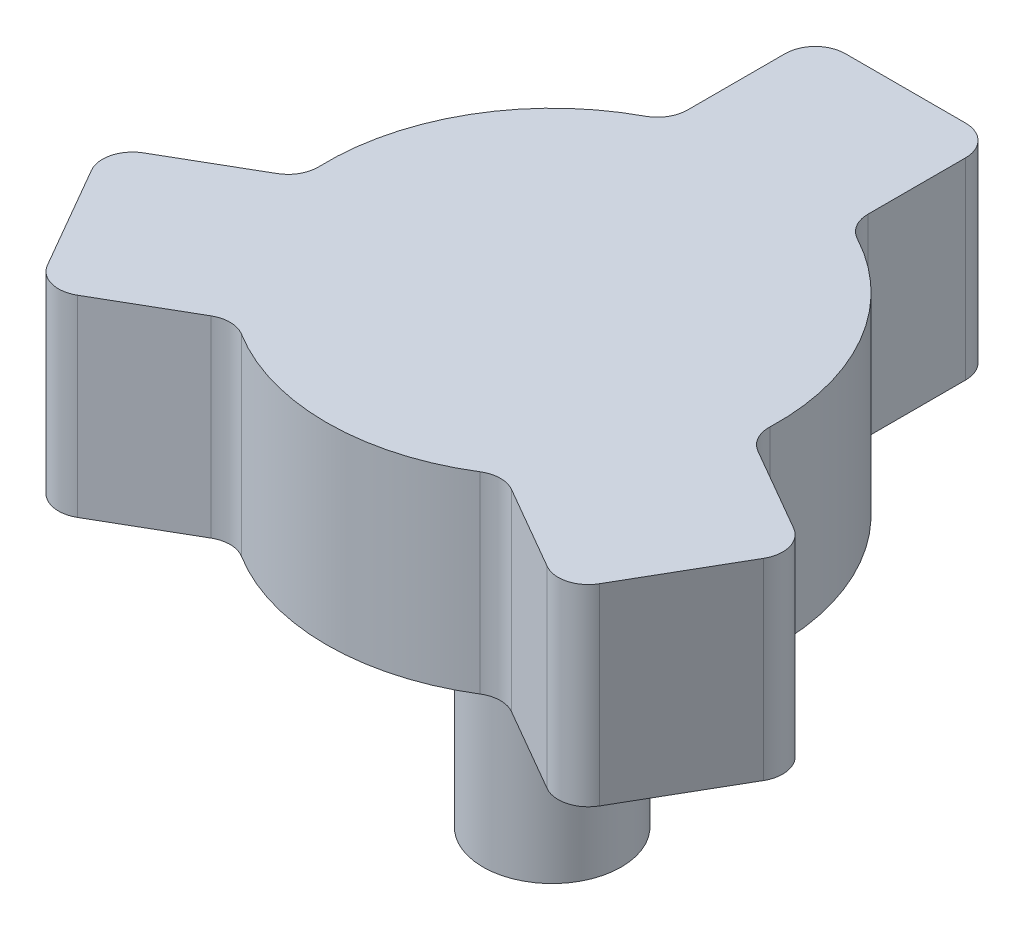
ISO-10303-21;
HEADER;
FILE_DESCRIPTION(('STEP AP214'),'2;1');
FILE_NAME('part.step','',(''),(''),'','','');
FILE_SCHEMA(('AUTOMOTIVE_DESIGN { 1 0 10303 214 1 1 1 1 }'));
ENDSEC;
DATA;
#1=APPLICATION_CONTEXT('core data for automotive mechanical design processes');
#2=APPLICATION_PROTOCOL_DEFINITION('international standard','automotive_design',2000,#1);
#3=PRODUCT_CONTEXT('',#1,'mechanical');
#4=PRODUCT('Part','Part','',(#3));
#5=PRODUCT_RELATED_PRODUCT_CATEGORY('part','',(#4));
#6=PRODUCT_DEFINITION_FORMATION('','',#4);
#7=PRODUCT_DEFINITION_CONTEXT('part definition',#1,'design');
#8=PRODUCT_DEFINITION('design','',#6,#7);
#9=PRODUCT_DEFINITION_SHAPE('','',#8);
#10=(LENGTH_UNIT() NAMED_UNIT(*) SI_UNIT(.MILLI.,.METRE.));
#11=(NAMED_UNIT(*) PLANE_ANGLE_UNIT() SI_UNIT($,.RADIAN.));
#12=(NAMED_UNIT(*) SI_UNIT($,.STERADIAN.) SOLID_ANGLE_UNIT());
#13=UNCERTAINTY_MEASURE_WITH_UNIT(LENGTH_MEASURE(1.E-05),#10,'distance_accuracy_value','');
#14=(GEOMETRIC_REPRESENTATION_CONTEXT(3) GLOBAL_UNCERTAINTY_ASSIGNED_CONTEXT((#13)) GLOBAL_UNIT_ASSIGNED_CONTEXT((#10,
#11,#12)) REPRESENTATION_CONTEXT('',''));
#15=CARTESIAN_POINT('',(0.,0.,0.));
#16=DIRECTION('',(0.,0.,1.));
#17=DIRECTION('',(1.,0.,0.));
#18=AXIS2_PLACEMENT_3D('',#15,#16,#17);
#19=CARTESIAN_POINT('',(0.,8.128,0.));
#20=DIRECTION('',(0.,-1.,0.));
#21=DIRECTION('',(0.,0.,-1.));
#22=AXIS2_PLACEMENT_3D('',#19,#20,#21);
#23=CYLINDRICAL_SURFACE('',#22,9.525);
#24=CARTESIAN_POINT('',(0.,0.,0.));
#25=DIRECTION('',(0.,1.,0.));
#26=DIRECTION('',(0.,0.,1.));
#27=AXIS2_PLACEMENT_3D('',#24,#25,#26);
#28=CIRCLE('',#27,9.525);
#29=CARTESIAN_POINT('',(-4.48235294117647,0.,-8.40441176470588));
#30=VERTEX_POINT('',#29);
#31=CARTESIAN_POINT('',(-9.51961056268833,0.,0.320374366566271));
#32=VERTEX_POINT('',#31);
#33=EDGE_CURVE('E211',#30,#32,#28,.T.);
#34=ORIENTED_EDGE('',*,*,#33,.T.);
#35=DIRECTION('',(0.,-1.,0.));
#36=VECTOR('',#35,1.);
#37=CARTESIAN_POINT('',(-9.51961056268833,8.128,0.320374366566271));
#38=LINE('',#37,#36);
#39=CARTESIAN_POINT('',(-9.51961056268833,8.128,0.320374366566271));
#40=VERTEX_POINT('',#39);
#41=EDGE_CURVE('E398',#32,#40,#38,.F.);
#42=ORIENTED_EDGE('',*,*,#41,.T.);
#43=CARTESIAN_POINT('',(0.,8.128,0.));
#44=DIRECTION('',(0.,1.,0.));
#45=DIRECTION('',(0.,0.,1.));
#46=AXIS2_PLACEMENT_3D('',#43,#44,#45);
#47=CIRCLE('',#46,9.525);
#48=CARTESIAN_POINT('',(-4.48235294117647,8.128,-8.40441176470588));
#49=VERTEX_POINT('',#48);
#50=EDGE_CURVE('E214',#49,#40,#47,.T.);
#51=ORIENTED_EDGE('',*,*,#50,.F.);
#52=DIRECTION('',(0.,-1.,0.));
#53=VECTOR('',#52,1.);
#54=CARTESIAN_POINT('',(-4.48235294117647,8.128,-8.40441176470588));
#55=LINE('',#54,#53);
#56=EDGE_CURVE('E199',#49,#30,#55,.T.);
#57=ORIENTED_EDGE('',*,*,#56,.T.);
#58=EDGE_LOOP('',(#34,#42,#51,#57));
#59=FACE_BOUND('',#58,.T.);
#60=ADVANCED_FACE('F33',(#59),#23,.T.);
#61=CARTESIAN_POINT('',(-5.03725762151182,0.,8.08403739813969));
#62=VERTEX_POINT('',#61);
#63=CARTESIAN_POINT('',(5.03725762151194,0.,8.08403739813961));
#64=VERTEX_POINT('',#63);
#65=EDGE_CURVE('E223',#62,#64,#28,.T.);
#66=ORIENTED_EDGE('',*,*,#65,.T.);
#67=DIRECTION('',(0.,-1.,0.));
#68=VECTOR('',#67,1.);
#69=CARTESIAN_POINT('',(5.03725762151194,8.128,8.08403739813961));
#70=LINE('',#69,#68);
#71=CARTESIAN_POINT('',(5.03725762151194,8.128,8.08403739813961));
#72=VERTEX_POINT('',#71);
#73=EDGE_CURVE('E269',#64,#72,#70,.F.);
#74=ORIENTED_EDGE('',*,*,#73,.T.);
#75=CARTESIAN_POINT('',(-5.03725762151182,8.128,8.08403739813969));
#76=VERTEX_POINT('',#75);
#77=EDGE_CURVE('E226',#76,#72,#47,.T.);
#78=ORIENTED_EDGE('',*,*,#77,.F.);
#79=DIRECTION('',(0.,-1.,0.));
#80=VECTOR('',#79,1.);
#81=CARTESIAN_POINT('',(-5.03725762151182,8.128,8.08403739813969));
#82=LINE('',#81,#80);
#83=EDGE_CURVE('E266',#76,#62,#82,.T.);
#84=ORIENTED_EDGE('',*,*,#83,.T.);
#85=EDGE_LOOP('',(#66,#74,#78,#84));
#86=FACE_BOUND('',#85,.T.);
#87=ADVANCED_FACE('F265',(#86),#23,.T.);
#88=CARTESIAN_POINT('',(9.51961056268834,8.128,0.320374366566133));
#89=VERTEX_POINT('',#88);
#90=CARTESIAN_POINT('',(4.48235294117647,8.128,-8.40441176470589));
#91=VERTEX_POINT('',#90);
#92=EDGE_CURVE('E222',#89,#91,#47,.T.);
#93=ORIENTED_EDGE('',*,*,#92,.F.);
#94=DIRECTION('',(0.,-1.,0.));
#95=VECTOR('',#94,1.);
#96=CARTESIAN_POINT('',(9.51961056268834,8.128,0.320374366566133));
#97=LINE('',#96,#95);
#98=CARTESIAN_POINT('',(9.51961056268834,0.,0.320374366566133));
#99=VERTEX_POINT('',#98);
#100=EDGE_CURVE('E308',#89,#99,#97,.T.);
#101=ORIENTED_EDGE('',*,*,#100,.T.);
#102=CARTESIAN_POINT('',(4.48235294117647,0.,-8.40441176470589));
#103=VERTEX_POINT('',#102);
#104=EDGE_CURVE('E225',#99,#103,#28,.T.);
#105=ORIENTED_EDGE('',*,*,#104,.T.);
#106=DIRECTION('',(0.,-1.,0.));
#107=VECTOR('',#106,1.);
#108=CARTESIAN_POINT('',(4.48235294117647,8.128,-8.40441176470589));
#109=LINE('',#108,#107);
#110=EDGE_CURVE('E215',#103,#91,#109,.F.);
#111=ORIENTED_EDGE('',*,*,#110,.T.);
#112=EDGE_LOOP('',(#93,#101,#105,#111));
#113=FACE_BOUND('',#112,.T.);
#114=ADVANCED_FACE('F324',(#113),#23,.T.);
#115=CARTESIAN_POINT('',(0.,8.128,0.));
#116=DIRECTION('',(0.,1.,0.));
#117=DIRECTION('',(0.,0.,1.));
#118=AXIS2_PLACEMENT_3D('',#115,#116,#117);
#119=PLANE('',#118);
#120=DIRECTION('',(0.866025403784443,0.,0.499999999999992));
#121=VECTOR('',#120,1.);
#122=CARTESIAN_POINT('',(11.0167753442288,8.128,10.7599472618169));
#123=LINE('',#122,#121);
#124=CARTESIAN_POINT('',(6.34389197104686,8.128,8.06205678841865));
#125=VERTEX_POINT('',#124);
#126=CARTESIAN_POINT('',(9.91692308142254,8.128,10.1249472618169));
#127=VERTEX_POINT('',#126);
#128=EDGE_CURVE('E341',#125,#127,#123,.T.);
#129=ORIENTED_EDGE('',*,*,#128,.T.);
#130=CARTESIAN_POINT('',(10.5519230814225,8.128,9.02509499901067));
#131=DIRECTION('',(0.,1.,0.));
#132=DIRECTION('',(0.,0.,1.));
#133=AXIS2_PLACEMENT_3D('',#130,#131,#132);
#134=CIRCLE('',#133,1.27);
#135=CARTESIAN_POINT('',(11.6517753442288,8.128,9.66009499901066));
#136=VERTEX_POINT('',#135);
#137=EDGE_CURVE('E297',#127,#136,#134,.T.);
#138=ORIENTED_EDGE('',*,*,#137,.T.);
#139=DIRECTION('',(0.499999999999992,0.,-0.866025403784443));
#140=VECTOR('',#139,1.);
#141=CARTESIAN_POINT('',(14.8267753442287,8.128,4.16083368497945));
#142=LINE('',#141,#140);
#143=CARTESIAN_POINT('',(14.1917753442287,8.128,5.26068594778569));
#144=VERTEX_POINT('',#143);
#145=EDGE_CURVE('E343',#136,#144,#142,.T.);
#146=ORIENTED_EDGE('',*,*,#145,.T.);
#147=CARTESIAN_POINT('',(13.0919230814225,8.128,4.6256859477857));
#148=DIRECTION('',(0.,1.,0.));
#149=DIRECTION('',(0.,0.,1.));
#150=AXIS2_PLACEMENT_3D('',#147,#148,#149);
#151=CIRCLE('',#150,1.27);
#152=CARTESIAN_POINT('',(13.7269230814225,8.128,3.52583368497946));
#153=VERTEX_POINT('',#152);
#154=EDGE_CURVE('E295',#144,#153,#151,.T.);
#155=ORIENTED_EDGE('',*,*,#154,.T.);
#156=DIRECTION('',(-0.866025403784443,0.,-0.499999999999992));
#157=VECTOR('',#156,1.);
#158=CARTESIAN_POINT('',(14.8267753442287,8.128,4.16083368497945));
#159=LINE('',#158,#157);
#160=CARTESIAN_POINT('',(10.1538919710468,8.128,1.46294321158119));
#161=VERTEX_POINT('',#160);
#162=EDGE_CURVE('E320',#153,#161,#159,.T.);
#163=ORIENTED_EDGE('',*,*,#162,.T.);
#164=CARTESIAN_POINT('',(10.7888919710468,8.128,0.363090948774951));
#165=DIRECTION('',(0.,1.,0.));
#166=DIRECTION('',(0.,0.,1.));
#167=AXIS2_PLACEMENT_3D('',#164,#165,#166);
#168=CIRCLE('',#167,1.27);
#169=EDGE_CURVE('E41',#161,#89,#168,.F.);
#170=ORIENTED_EDGE('',*,*,#169,.T.);
#171=ORIENTED_EDGE('',*,*,#92,.T.);
#172=CARTESIAN_POINT('',(5.08,8.128,-9.525));
#173=DIRECTION('',(0.,1.,0.));
#174=DIRECTION('',(0.,0.,1.));
#175=AXIS2_PLACEMENT_3D('',#172,#173,#174);
#176=CIRCLE('',#175,1.27);
#177=CARTESIAN_POINT('',(3.81,8.128,-9.525));
#178=VERTEX_POINT('',#177);
#179=EDGE_CURVE('E394',#91,#178,#176,.F.);
#180=ORIENTED_EDGE('',*,*,#179,.T.);
#181=DIRECTION('',(0.,0.,-1.));
#182=VECTOR('',#181,1.);
#183=CARTESIAN_POINT('',(3.80999999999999,8.128,-14.9207809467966));
#184=LINE('',#183,#182);
#185=CARTESIAN_POINT('',(3.80999999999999,8.128,-13.6507809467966));
#186=VERTEX_POINT('',#185);
#187=EDGE_CURVE('E242',#178,#186,#184,.T.);
#188=ORIENTED_EDGE('',*,*,#187,.T.);
#189=CARTESIAN_POINT('',(2.54,8.128,-13.6507809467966));
#190=DIRECTION('',(0.,1.,0.));
#191=DIRECTION('',(0.,0.,1.));
#192=AXIS2_PLACEMENT_3D('',#189,#190,#191);
#193=CIRCLE('',#192,1.27);
#194=CARTESIAN_POINT('',(2.54,8.128,-14.9207809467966));
#195=VERTEX_POINT('',#194);
#196=EDGE_CURVE('E375',#186,#195,#193,.T.);
#197=ORIENTED_EDGE('',*,*,#196,.T.);
#198=DIRECTION('',(-1.,0.,0.));
#199=VECTOR('',#198,1.);
#200=CARTESIAN_POINT('',(-3.81,8.128,-14.9207809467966));
#201=LINE('',#200,#199);
#202=CARTESIAN_POINT('',(-2.54,8.128,-14.9207809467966));
#203=VERTEX_POINT('',#202);
#204=EDGE_CURVE('E245',#195,#203,#201,.T.);
#205=ORIENTED_EDGE('',*,*,#204,.T.);
#206=CARTESIAN_POINT('',(-2.54,8.128,-13.6507809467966));
#207=DIRECTION('',(0.,1.,0.));
#208=DIRECTION('',(0.,0.,1.));
#209=AXIS2_PLACEMENT_3D('',#206,#207,#208);
#210=CIRCLE('',#209,1.27);
#211=CARTESIAN_POINT('',(-3.81,8.128,-13.6507809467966));
#212=VERTEX_POINT('',#211);
#213=EDGE_CURVE('E377',#203,#212,#210,.T.);
#214=ORIENTED_EDGE('',*,*,#213,.T.);
#215=DIRECTION('',(0.,0.,1.));
#216=VECTOR('',#215,1.);
#217=CARTESIAN_POINT('',(-3.81,8.128,-14.9207809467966));
#218=LINE('',#217,#216);
#219=CARTESIAN_POINT('',(-3.81,8.128,-9.525));
#220=VERTEX_POINT('',#219);
#221=EDGE_CURVE('E249',#212,#220,#218,.T.);
#222=ORIENTED_EDGE('',*,*,#221,.T.);
#223=CARTESIAN_POINT('',(-5.08,8.128,-9.525));
#224=DIRECTION('',(0.,1.,0.));
#225=DIRECTION('',(0.,0.,1.));
#226=AXIS2_PLACEMENT_3D('',#223,#224,#225);
#227=CIRCLE('',#226,1.27);
#228=EDGE_CURVE('E204',#220,#49,#227,.F.);
#229=ORIENTED_EDGE('',*,*,#228,.T.);
#230=ORIENTED_EDGE('',*,*,#50,.T.);
#231=CARTESIAN_POINT('',(-10.7888919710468,8.128,0.363090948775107));
#232=DIRECTION('',(0.,1.,0.));
#233=DIRECTION('',(0.,0.,1.));
#234=AXIS2_PLACEMENT_3D('',#231,#232,#233);
#235=CIRCLE('',#234,1.27);
#236=CARTESIAN_POINT('',(-10.1538919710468,8.128,1.46294321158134));
#237=VERTEX_POINT('',#236);
#238=EDGE_CURVE('E284',#40,#237,#235,.F.);
#239=ORIENTED_EDGE('',*,*,#238,.T.);
#240=DIRECTION('',(-0.866025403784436,0.,0.500000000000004));
#241=VECTOR('',#240,1.);
#242=CARTESIAN_POINT('',(-14.8267753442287,8.128,4.16083368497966));
#243=LINE('',#242,#241);
#244=CARTESIAN_POINT('',(-13.7269230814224,8.128,3.52583368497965));
#245=VERTEX_POINT('',#244);
#246=EDGE_CURVE('E330',#237,#245,#243,.T.);
#247=ORIENTED_EDGE('',*,*,#246,.T.);
#248=CARTESIAN_POINT('',(-13.0919230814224,8.128,4.62568594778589));
#249=DIRECTION('',(0.,1.,0.));
#250=DIRECTION('',(0.,0.,1.));
#251=AXIS2_PLACEMENT_3D('',#248,#249,#250);
#252=CIRCLE('',#251,1.27);
#253=CARTESIAN_POINT('',(-14.1917753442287,8.128,5.26068594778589));
#254=VERTEX_POINT('',#253);
#255=EDGE_CURVE('E407',#245,#254,#252,.T.);
#256=ORIENTED_EDGE('',*,*,#255,.T.);
#257=DIRECTION('',(0.500000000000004,0.,0.866025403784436));
#258=VECTOR('',#257,1.);
#259=CARTESIAN_POINT('',(-11.0167753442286,8.128,10.7599472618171));
#260=LINE('',#259,#258);
#261=CARTESIAN_POINT('',(-11.6517753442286,8.128,9.66009499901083));
#262=VERTEX_POINT('',#261);
#263=EDGE_CURVE('E334',#254,#262,#260,.T.);
#264=ORIENTED_EDGE('',*,*,#263,.T.);
#265=CARTESIAN_POINT('',(-10.5519230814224,8.128,9.02509499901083));
#266=DIRECTION('',(0.,1.,0.));
#267=DIRECTION('',(0.,0.,1.));
#268=AXIS2_PLACEMENT_3D('',#265,#266,#267);
#269=CIRCLE('',#268,1.27);
#270=CARTESIAN_POINT('',(-9.91692308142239,8.128,10.1249472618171));
#271=VERTEX_POINT('',#270);
#272=EDGE_CURVE('E405',#262,#271,#269,.T.);
#273=ORIENTED_EDGE('',*,*,#272,.T.);
#274=DIRECTION('',(0.866025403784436,0.,-0.500000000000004));
#275=VECTOR('',#274,1.);
#276=CARTESIAN_POINT('',(-11.0167753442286,8.128,10.7599472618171));
#277=LINE('',#276,#275);
#278=CARTESIAN_POINT('',(-6.34389197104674,8.128,8.06205678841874));
#279=VERTEX_POINT('',#278);
#280=EDGE_CURVE('E352',#271,#279,#277,.T.);
#281=ORIENTED_EDGE('',*,*,#280,.T.);
#282=CARTESIAN_POINT('',(-5.70889197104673,8.128,9.16190905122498));
#283=DIRECTION('',(0.,1.,0.));
#284=DIRECTION('',(0.,0.,1.));
#285=AXIS2_PLACEMENT_3D('',#282,#283,#284);
#286=CIRCLE('',#285,1.27);
#287=EDGE_CURVE('E260',#279,#76,#286,.F.);
#288=ORIENTED_EDGE('',*,*,#287,.T.);
#289=ORIENTED_EDGE('',*,*,#77,.T.);
#290=CARTESIAN_POINT('',(5.70889197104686,8.128,9.1619090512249));
#291=DIRECTION('',(0.,1.,0.));
#292=DIRECTION('',(0.,0.,1.));
#293=AXIS2_PLACEMENT_3D('',#290,#291,#292);
#294=CIRCLE('',#293,1.27);
#295=EDGE_CURVE('E256',#72,#125,#294,.F.);
#296=ORIENTED_EDGE('',*,*,#295,.T.);
#297=EDGE_LOOP('',(#129,#138,#146,#155,#163,#170,#171,#180,#188,#197,#205,#214,#222,#229,#230,
#239,#247,#256,#264,#273,#281,#288,#289,#296));
#298=FACE_BOUND('',#297,.T.);
#299=ADVANCED_FACE('F255',(#298),#119,.T.);
#300=CARTESIAN_POINT('',(0.,0.,0.));
#301=DIRECTION('',(0.,1.,0.));
#302=DIRECTION('',(0.,0.,1.));
#303=AXIS2_PLACEMENT_3D('',#300,#301,#302);
#304=PLANE('',#303);
#305=CARTESIAN_POINT('',(0.,0.,0.));
#306=DIRECTION('',(0.,1.,0.));
#307=DIRECTION('',(0.,0.,1.));
#308=AXIS2_PLACEMENT_3D('',#305,#306,#307);
#309=CIRCLE('',#308,2.921);
#310=CARTESIAN_POINT('',(0.,0.,2.921));
#311=VERTEX_POINT('',#310);
#312=EDGE_CURVE('E11',#311,#311,#309,.F.);
#313=ORIENTED_EDGE('',*,*,#312,.F.);
#314=EDGE_LOOP('',(#313));
#315=FACE_BOUND('',#314,.T.);
#316=DIRECTION('',(0.499999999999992,0.,-0.866025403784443));
#317=VECTOR('',#316,1.);
#318=CARTESIAN_POINT('',(14.8267753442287,0.,4.16083368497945));
#319=LINE('',#318,#317);
#320=CARTESIAN_POINT('',(11.6517753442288,0.,9.66009499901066));
#321=VERTEX_POINT('',#320);
#322=CARTESIAN_POINT('',(14.1917753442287,0.,5.26068594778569));
#323=VERTEX_POINT('',#322);
#324=EDGE_CURVE('E331',#321,#323,#319,.T.);
#325=ORIENTED_EDGE('',*,*,#324,.F.);
#326=CARTESIAN_POINT('',(10.5519230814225,0.,9.02509499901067));
#327=DIRECTION('',(0.,1.,0.));
#328=DIRECTION('',(0.,0.,1.));
#329=AXIS2_PLACEMENT_3D('',#326,#327,#328);
#330=CIRCLE('',#329,1.27);
#331=CARTESIAN_POINT('',(9.91692308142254,0.,10.1249472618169));
#332=VERTEX_POINT('',#331);
#333=EDGE_CURVE('E306',#321,#332,#330,.F.);
#334=ORIENTED_EDGE('',*,*,#333,.T.);
#335=DIRECTION('',(0.866025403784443,0.,0.499999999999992));
#336=VECTOR('',#335,1.);
#337=CARTESIAN_POINT('',(11.0167753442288,0.,10.7599472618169));
#338=LINE('',#337,#336);
#339=CARTESIAN_POINT('',(6.34389197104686,0.,8.06205678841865));
#340=VERTEX_POINT('',#339);
#341=EDGE_CURVE('E337',#340,#332,#338,.T.);
#342=ORIENTED_EDGE('',*,*,#341,.F.);
#343=CARTESIAN_POINT('',(5.70889197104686,0.,9.1619090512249));
#344=DIRECTION('',(0.,1.,0.));
#345=DIRECTION('',(0.,0.,1.));
#346=AXIS2_PLACEMENT_3D('',#343,#344,#345);
#347=CIRCLE('',#346,1.27);
#348=EDGE_CURVE('E314',#340,#64,#347,.T.);
#349=ORIENTED_EDGE('',*,*,#348,.T.);
#350=ORIENTED_EDGE('',*,*,#65,.F.);
#351=CARTESIAN_POINT('',(-5.70889197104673,0.,9.16190905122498));
#352=DIRECTION('',(0.,1.,0.));
#353=DIRECTION('',(0.,0.,1.));
#354=AXIS2_PLACEMENT_3D('',#351,#352,#353);
#355=CIRCLE('',#354,1.27);
#356=CARTESIAN_POINT('',(-6.34389197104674,0.,8.06205678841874));
#357=VERTEX_POINT('',#356);
#358=EDGE_CURVE('E273',#62,#357,#355,.T.);
#359=ORIENTED_EDGE('',*,*,#358,.T.);
#360=DIRECTION('',(0.866025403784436,0.,-0.500000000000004));
#361=VECTOR('',#360,1.);
#362=CARTESIAN_POINT('',(-11.0167753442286,0.,10.7599472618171));
#363=LINE('',#362,#361);
#364=CARTESIAN_POINT('',(-9.91692308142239,0.,10.1249472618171));
#365=VERTEX_POINT('',#364);
#366=EDGE_CURVE('E246',#365,#357,#363,.T.);
#367=ORIENTED_EDGE('',*,*,#366,.F.);
#368=CARTESIAN_POINT('',(-10.5519230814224,0.,9.02509499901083));
#369=DIRECTION('',(0.,1.,0.));
#370=DIRECTION('',(0.,0.,1.));
#371=AXIS2_PLACEMENT_3D('',#368,#369,#370);
#372=CIRCLE('',#371,1.27);
#373=CARTESIAN_POINT('',(-11.6517753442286,0.,9.66009499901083));
#374=VERTEX_POINT('',#373);
#375=EDGE_CURVE('E279',#365,#374,#372,.F.);
#376=ORIENTED_EDGE('',*,*,#375,.T.);
#377=DIRECTION('',(0.500000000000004,0.,0.866025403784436));
#378=VECTOR('',#377,1.);
#379=CARTESIAN_POINT('',(-11.0167753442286,0.,10.7599472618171));
#380=LINE('',#379,#378);
#381=CARTESIAN_POINT('',(-14.1917753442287,0.,5.26068594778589));
#382=VERTEX_POINT('',#381);
#383=EDGE_CURVE('E351',#382,#374,#380,.T.);
#384=ORIENTED_EDGE('',*,*,#383,.F.);
#385=CARTESIAN_POINT('',(-13.0919230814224,0.,4.62568594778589));
#386=DIRECTION('',(0.,1.,0.));
#387=DIRECTION('',(0.,0.,1.));
#388=AXIS2_PLACEMENT_3D('',#385,#386,#387);
#389=CIRCLE('',#388,1.27);
#390=CARTESIAN_POINT('',(-13.7269230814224,0.,3.52583368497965));
#391=VERTEX_POINT('',#390);
#392=EDGE_CURVE('E275',#382,#391,#389,.F.);
#393=ORIENTED_EDGE('',*,*,#392,.T.);
#394=DIRECTION('',(-0.866025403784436,0.,0.500000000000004));
#395=VECTOR('',#394,1.);
#396=CARTESIAN_POINT('',(-14.8267753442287,0.,4.16083368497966));
#397=LINE('',#396,#395);
#398=CARTESIAN_POINT('',(-10.1538919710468,0.,1.46294321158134));
#399=VERTEX_POINT('',#398);
#400=EDGE_CURVE('E348',#399,#391,#397,.T.);
#401=ORIENTED_EDGE('',*,*,#400,.F.);
#402=CARTESIAN_POINT('',(-10.7888919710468,0.,0.363090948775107));
#403=DIRECTION('',(0.,1.,0.));
#404=DIRECTION('',(0.,0.,1.));
#405=AXIS2_PLACEMENT_3D('',#402,#403,#404);
#406=CIRCLE('',#405,1.27);
#407=EDGE_CURVE('E221',#399,#32,#406,.T.);
#408=ORIENTED_EDGE('',*,*,#407,.T.);
#409=ORIENTED_EDGE('',*,*,#33,.F.);
#410=CARTESIAN_POINT('',(-5.08,0.,-9.525));
#411=DIRECTION('',(0.,1.,0.));
#412=DIRECTION('',(0.,0.,1.));
#413=AXIS2_PLACEMENT_3D('',#410,#411,#412);
#414=CIRCLE('',#413,1.27);
#415=CARTESIAN_POINT('',(-3.81,0.,-9.525));
#416=VERTEX_POINT('',#415);
#417=EDGE_CURVE('E195',#30,#416,#414,.T.);
#418=ORIENTED_EDGE('',*,*,#417,.T.);
#419=DIRECTION('',(0.,0.,1.));
#420=VECTOR('',#419,1.);
#421=CARTESIAN_POINT('',(-3.81,0.,-14.9207809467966));
#422=LINE('',#421,#420);
#423=CARTESIAN_POINT('',(-3.81,0.,-13.6507809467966));
#424=VERTEX_POINT('',#423);
#425=EDGE_CURVE('E229',#424,#416,#422,.T.);
#426=ORIENTED_EDGE('',*,*,#425,.F.);
#427=CARTESIAN_POINT('',(-2.54,0.,-13.6507809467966));
#428=DIRECTION('',(0.,1.,0.));
#429=DIRECTION('',(0.,0.,1.));
#430=AXIS2_PLACEMENT_3D('',#427,#428,#429);
#431=CIRCLE('',#430,1.27);
#432=CARTESIAN_POINT('',(-2.54,0.,-14.9207809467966));
#433=VERTEX_POINT('',#432);
#434=EDGE_CURVE('E388',#424,#433,#431,.F.);
#435=ORIENTED_EDGE('',*,*,#434,.T.);
#436=DIRECTION('',(-1.,0.,0.));
#437=VECTOR('',#436,1.);
#438=CARTESIAN_POINT('',(-3.81,0.,-14.9207809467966));
#439=LINE('',#438,#437);
#440=CARTESIAN_POINT('',(2.54,0.,-14.9207809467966));
#441=VERTEX_POINT('',#440);
#442=EDGE_CURVE('E234',#441,#433,#439,.T.);
#443=ORIENTED_EDGE('',*,*,#442,.F.);
#444=CARTESIAN_POINT('',(2.54,0.,-13.6507809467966));
#445=DIRECTION('',(0.,1.,0.));
#446=DIRECTION('',(0.,0.,1.));
#447=AXIS2_PLACEMENT_3D('',#444,#445,#446);
#448=CIRCLE('',#447,1.27);
#449=CARTESIAN_POINT('',(3.80999999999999,0.,-13.6507809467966));
#450=VERTEX_POINT('',#449);
#451=EDGE_CURVE('E374',#441,#450,#448,.F.);
#452=ORIENTED_EDGE('',*,*,#451,.T.);
#453=DIRECTION('',(0.,0.,-1.));
#454=VECTOR('',#453,1.);
#455=CARTESIAN_POINT('',(3.80999999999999,0.,-14.9207809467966));
#456=LINE('',#455,#454);
#457=CARTESIAN_POINT('',(3.81,0.,-9.525));
#458=VERTEX_POINT('',#457);
#459=EDGE_CURVE('E238',#458,#450,#456,.T.);
#460=ORIENTED_EDGE('',*,*,#459,.F.);
#461=CARTESIAN_POINT('',(5.08,0.,-9.525));
#462=DIRECTION('',(0.,1.,0.));
#463=DIRECTION('',(0.,0.,1.));
#464=AXIS2_PLACEMENT_3D('',#461,#462,#463);
#465=CIRCLE('',#464,1.27);
#466=EDGE_CURVE('E205',#458,#103,#465,.T.);
#467=ORIENTED_EDGE('',*,*,#466,.T.);
#468=ORIENTED_EDGE('',*,*,#104,.F.);
#469=CARTESIAN_POINT('',(10.7888919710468,0.,0.363090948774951));
#470=DIRECTION('',(0.,1.,0.));
#471=DIRECTION('',(0.,0.,1.));
#472=AXIS2_PLACEMENT_3D('',#469,#470,#471);
#473=CIRCLE('',#472,1.27);
#474=CARTESIAN_POINT('',(10.1538919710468,0.,1.46294321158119));
#475=VERTEX_POINT('',#474);
#476=EDGE_CURVE('E48',#99,#475,#473,.T.);
#477=ORIENTED_EDGE('',*,*,#476,.T.);
#478=DIRECTION('',(-0.866025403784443,0.,-0.499999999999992));
#479=VECTOR('',#478,1.);
#480=CARTESIAN_POINT('',(14.8267753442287,0.,4.16083368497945));
#481=LINE('',#480,#479);
#482=CARTESIAN_POINT('',(13.7269230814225,0.,3.52583368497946));
#483=VERTEX_POINT('',#482);
#484=EDGE_CURVE('E328',#483,#475,#481,.T.);
#485=ORIENTED_EDGE('',*,*,#484,.F.);
#486=CARTESIAN_POINT('',(13.0919230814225,0.,4.6256859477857));
#487=DIRECTION('',(0.,1.,0.));
#488=DIRECTION('',(0.,0.,1.));
#489=AXIS2_PLACEMENT_3D('',#486,#487,#488);
#490=CIRCLE('',#489,1.27);
#491=EDGE_CURVE('E304',#483,#323,#490,.F.);
#492=ORIENTED_EDGE('',*,*,#491,.T.);
#493=EDGE_LOOP('',(#325,#334,#342,#349,#350,#359,#367,#376,#384,#393,#401,#408,#409,#418,#426,
#435,#443,#452,#460,#467,#468,#477,#485,#492));
#494=FACE_BOUND('',#493,.T.);
#495=ADVANCED_FACE('F218',(#315,#494),#304,.F.);
#496=CARTESIAN_POINT('',(3.80999999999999,0.,-14.9207809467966));
#497=DIRECTION('',(1.,0.,0.));
#498=DIRECTION('',(0.,0.,-1.));
#499=AXIS2_PLACEMENT_3D('',#496,#497,#498);
#500=PLANE('',#499);
#501=ORIENTED_EDGE('',*,*,#187,.F.);
#502=DIRECTION('',(0.,-1.,0.));
#503=VECTOR('',#502,1.);
#504=CARTESIAN_POINT('',(3.81,0.,-9.525));
#505=LINE('',#504,#503);
#506=EDGE_CURVE('E368',#178,#458,#505,.T.);
#507=ORIENTED_EDGE('',*,*,#506,.T.);
#508=ORIENTED_EDGE('',*,*,#459,.T.);
#509=DIRECTION('',(0.,1.,0.));
#510=VECTOR('',#509,1.);
#511=CARTESIAN_POINT('',(3.80999999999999,0.,-13.6507809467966));
#512=LINE('',#511,#510);
#513=EDGE_CURVE('E366',#450,#186,#512,.T.);
#514=ORIENTED_EDGE('',*,*,#513,.T.);
#515=EDGE_LOOP('',(#501,#507,#508,#514));
#516=FACE_BOUND('',#515,.T.);
#517=ADVANCED_FACE('F365',(#516),#500,.T.);
#518=CARTESIAN_POINT('',(-3.81,0.,-14.9207809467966));
#519=DIRECTION('',(-1.,0.,0.));
#520=DIRECTION('',(0.,0.,1.));
#521=AXIS2_PLACEMENT_3D('',#518,#519,#520);
#522=PLANE('',#521);
#523=ORIENTED_EDGE('',*,*,#425,.T.);
#524=DIRECTION('',(0.,-1.,0.));
#525=VECTOR('',#524,1.);
#526=CARTESIAN_POINT('',(-3.81,0.,-9.525));
#527=LINE('',#526,#525);
#528=EDGE_CURVE('E200',#416,#220,#527,.F.);
#529=ORIENTED_EDGE('',*,*,#528,.T.);
#530=ORIENTED_EDGE('',*,*,#221,.F.);
#531=DIRECTION('',(0.,1.,0.));
#532=VECTOR('',#531,1.);
#533=CARTESIAN_POINT('',(-3.81,0.,-13.6507809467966));
#534=LINE('',#533,#532);
#535=EDGE_CURVE('E391',#212,#424,#534,.F.);
#536=ORIENTED_EDGE('',*,*,#535,.T.);
#537=EDGE_LOOP('',(#523,#529,#530,#536));
#538=FACE_BOUND('',#537,.T.);
#539=ADVANCED_FACE('F460',(#538),#522,.T.);
#540=CARTESIAN_POINT('',(-3.81,0.,-14.9207809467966));
#541=DIRECTION('',(0.,0.,-1.));
#542=DIRECTION('',(-1.,0.,0.));
#543=AXIS2_PLACEMENT_3D('',#540,#541,#542);
#544=PLANE('',#543);
#545=ORIENTED_EDGE('',*,*,#204,.F.);
#546=DIRECTION('',(0.,1.,0.));
#547=VECTOR('',#546,1.);
#548=CARTESIAN_POINT('',(2.54,0.,-14.9207809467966));
#549=LINE('',#548,#547);
#550=EDGE_CURVE('E386',#195,#441,#549,.F.);
#551=ORIENTED_EDGE('',*,*,#550,.T.);
#552=ORIENTED_EDGE('',*,*,#442,.T.);
#553=DIRECTION('',(0.,1.,0.));
#554=VECTOR('',#553,1.);
#555=CARTESIAN_POINT('',(-2.54,0.,-14.9207809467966));
#556=LINE('',#555,#554);
#557=EDGE_CURVE('E383',#433,#203,#556,.T.);
#558=ORIENTED_EDGE('',*,*,#557,.T.);
#559=EDGE_LOOP('',(#545,#551,#552,#558));
#560=FACE_BOUND('',#559,.T.);
#561=ADVANCED_FACE('F461',(#560),#544,.T.);
#562=CARTESIAN_POINT('',(5.08,8.128,-9.525));
#563=DIRECTION('',(0.,-1.,0.));
#564=DIRECTION('',(0.,0.,-1.));
#565=AXIS2_PLACEMENT_3D('',#562,#563,#564);
#566=CYLINDRICAL_SURFACE('',#565,1.27);
#567=ORIENTED_EDGE('',*,*,#466,.F.);
#568=ORIENTED_EDGE('',*,*,#506,.F.);
#569=ORIENTED_EDGE('',*,*,#179,.F.);
#570=ORIENTED_EDGE('',*,*,#110,.F.);
#571=EDGE_LOOP('',(#567,#568,#569,#570));
#572=FACE_BOUND('',#571,.T.);
#573=ADVANCED_FACE('F464',(#572),#566,.F.);
#574=CARTESIAN_POINT('',(2.54,0.,-13.6507809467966));
#575=DIRECTION('',(0.,1.,0.));
#576=DIRECTION('',(0.,0.,1.));
#577=AXIS2_PLACEMENT_3D('',#574,#575,#576);
#578=CYLINDRICAL_SURFACE('',#577,1.27);
#579=ORIENTED_EDGE('',*,*,#451,.F.);
#580=ORIENTED_EDGE('',*,*,#550,.F.);
#581=ORIENTED_EDGE('',*,*,#196,.F.);
#582=ORIENTED_EDGE('',*,*,#513,.F.);
#583=EDGE_LOOP('',(#579,#580,#581,#582));
#584=FACE_BOUND('',#583,.T.);
#585=ADVANCED_FACE('F372',(#584),#578,.T.);
#586=CARTESIAN_POINT('',(-5.08,8.128,-9.525));
#587=DIRECTION('',(0.,-1.,0.));
#588=DIRECTION('',(0.,0.,-1.));
#589=AXIS2_PLACEMENT_3D('',#586,#587,#588);
#590=CYLINDRICAL_SURFACE('',#589,1.27);
#591=ORIENTED_EDGE('',*,*,#228,.F.);
#592=ORIENTED_EDGE('',*,*,#528,.F.);
#593=ORIENTED_EDGE('',*,*,#417,.F.);
#594=ORIENTED_EDGE('',*,*,#56,.F.);
#595=EDGE_LOOP('',(#591,#592,#593,#594));
#596=FACE_BOUND('',#595,.T.);
#597=ADVANCED_FACE('F198',(#596),#590,.F.);
#598=CARTESIAN_POINT('',(-2.54,0.,-13.6507809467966));
#599=DIRECTION('',(0.,1.,0.));
#600=DIRECTION('',(0.,0.,1.));
#601=AXIS2_PLACEMENT_3D('',#598,#599,#600);
#602=CYLINDRICAL_SURFACE('',#601,1.27);
#603=ORIENTED_EDGE('',*,*,#434,.F.);
#604=ORIENTED_EDGE('',*,*,#535,.F.);
#605=ORIENTED_EDGE('',*,*,#213,.F.);
#606=ORIENTED_EDGE('',*,*,#557,.F.);
#607=EDGE_LOOP('',(#603,#604,#605,#606));
#608=FACE_BOUND('',#607,.T.);
#609=ADVANCED_FACE('F493',(#608),#602,.T.);
#610=CARTESIAN_POINT('',(14.8267753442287,0.,4.16083368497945));
#611=DIRECTION('',(0.866025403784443,0.,0.499999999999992));
#612=DIRECTION('',(0.499999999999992,0.,-0.866025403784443));
#613=AXIS2_PLACEMENT_3D('',#610,#611,#612);
#614=PLANE('',#613);
#615=ORIENTED_EDGE('',*,*,#145,.F.);
#616=DIRECTION('',(0.,1.,0.));
#617=VECTOR('',#616,1.);
#618=CARTESIAN_POINT('',(11.6517753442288,0.,9.66009499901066));
#619=LINE('',#618,#617);
#620=EDGE_CURVE('E302',#136,#321,#619,.F.);
#621=ORIENTED_EDGE('',*,*,#620,.T.);
#622=ORIENTED_EDGE('',*,*,#324,.T.);
#623=DIRECTION('',(0.,1.,0.));
#624=VECTOR('',#623,1.);
#625=CARTESIAN_POINT('',(14.1917753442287,0.,5.26068594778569));
#626=LINE('',#625,#624);
#627=EDGE_CURVE('E299',#323,#144,#626,.T.);
#628=ORIENTED_EDGE('',*,*,#627,.T.);
#629=EDGE_LOOP('',(#615,#621,#622,#628));
#630=FACE_BOUND('',#629,.T.);
#631=ADVANCED_FACE('F500',(#630),#614,.T.);
#632=CARTESIAN_POINT('',(14.8267753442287,0.,4.16083368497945));
#633=DIRECTION('',(0.499999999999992,0.,-0.866025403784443));
#634=DIRECTION('',(-0.866025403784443,0.,-0.499999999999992));
#635=AXIS2_PLACEMENT_3D('',#632,#633,#634);
#636=PLANE('',#635);
#637=ORIENTED_EDGE('',*,*,#484,.T.);
#638=DIRECTION('',(0.,-1.,0.));
#639=VECTOR('',#638,1.);
#640=CARTESIAN_POINT('',(10.1538919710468,0.,1.46294321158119));
#641=LINE('',#640,#639);
#642=EDGE_CURVE('E311',#475,#161,#641,.F.);
#643=ORIENTED_EDGE('',*,*,#642,.T.);
#644=ORIENTED_EDGE('',*,*,#162,.F.);
#645=DIRECTION('',(0.,1.,0.));
#646=VECTOR('',#645,1.);
#647=CARTESIAN_POINT('',(13.7269230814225,0.,3.52583368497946));
#648=LINE('',#647,#646);
#649=EDGE_CURVE('E55',#153,#483,#648,.F.);
#650=ORIENTED_EDGE('',*,*,#649,.T.);
#651=EDGE_LOOP('',(#637,#643,#644,#650));
#652=FACE_BOUND('',#651,.T.);
#653=ADVANCED_FACE('F327',(#652),#636,.T.);
#654=CARTESIAN_POINT('',(11.0167753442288,0.,10.7599472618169));
#655=DIRECTION('',(-0.499999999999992,0.,0.866025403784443));
#656=DIRECTION('',(0.866025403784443,0.,0.499999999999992));
#657=AXIS2_PLACEMENT_3D('',#654,#655,#656);
#658=PLANE('',#657);
#659=ORIENTED_EDGE('',*,*,#128,.F.);
#660=DIRECTION('',(0.,-1.,0.));
#661=VECTOR('',#660,1.);
#662=CARTESIAN_POINT('',(6.34389197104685,0.,8.06205678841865));
#663=LINE('',#662,#661);
#664=EDGE_CURVE('E293',#125,#340,#663,.T.);
#665=ORIENTED_EDGE('',*,*,#664,.T.);
#666=ORIENTED_EDGE('',*,*,#341,.T.);
#667=DIRECTION('',(0.,1.,0.));
#668=VECTOR('',#667,1.);
#669=CARTESIAN_POINT('',(9.91692308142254,0.,10.1249472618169));
#670=LINE('',#669,#668);
#671=EDGE_CURVE('E290',#332,#127,#670,.T.);
#672=ORIENTED_EDGE('',*,*,#671,.T.);
#673=EDGE_LOOP('',(#659,#665,#666,#672));
#674=FACE_BOUND('',#673,.T.);
#675=ADVANCED_FACE('F437',(#674),#658,.T.);
#676=CARTESIAN_POINT('',(-14.8267753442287,0.,4.16083368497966));
#677=DIRECTION('',(-0.500000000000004,0.,-0.866025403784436));
#678=DIRECTION('',(-0.866025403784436,0.,0.500000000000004));
#679=AXIS2_PLACEMENT_3D('',#676,#677,#678);
#680=PLANE('',#679);
#681=ORIENTED_EDGE('',*,*,#246,.F.);
#682=DIRECTION('',(0.,-1.,0.));
#683=VECTOR('',#682,1.);
#684=CARTESIAN_POINT('',(-10.1538919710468,0.,1.46294321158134));
#685=LINE('',#684,#683);
#686=EDGE_CURVE('E403',#237,#399,#685,.T.);
#687=ORIENTED_EDGE('',*,*,#686,.T.);
#688=ORIENTED_EDGE('',*,*,#400,.T.);
#689=DIRECTION('',(0.,1.,0.));
#690=VECTOR('',#689,1.);
#691=CARTESIAN_POINT('',(-13.7269230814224,0.,3.52583368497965));
#692=LINE('',#691,#690);
#693=EDGE_CURVE('E400',#391,#245,#692,.T.);
#694=ORIENTED_EDGE('',*,*,#693,.T.);
#695=EDGE_LOOP('',(#681,#687,#688,#694));
#696=FACE_BOUND('',#695,.T.);
#697=ADVANCED_FACE('F429',(#696),#680,.T.);
#698=CARTESIAN_POINT('',(-11.0167753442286,0.,10.7599472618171));
#699=DIRECTION('',(0.500000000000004,0.,0.866025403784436));
#700=DIRECTION('',(0.866025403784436,0.,-0.500000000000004));
#701=AXIS2_PLACEMENT_3D('',#698,#699,#700);
#702=PLANE('',#701);
#703=ORIENTED_EDGE('',*,*,#366,.T.);
#704=DIRECTION('',(0.,-1.,0.));
#705=VECTOR('',#704,1.);
#706=CARTESIAN_POINT('',(-6.34389197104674,0.,8.06205678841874));
#707=LINE('',#706,#705);
#708=EDGE_CURVE('E277',#357,#279,#707,.F.);
#709=ORIENTED_EDGE('',*,*,#708,.T.);
#710=ORIENTED_EDGE('',*,*,#280,.F.);
#711=DIRECTION('',(0.,1.,0.));
#712=VECTOR('',#711,1.);
#713=CARTESIAN_POINT('',(-9.91692308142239,0.,10.1249472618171));
#714=LINE('',#713,#712);
#715=EDGE_CURVE('E274',#271,#365,#714,.F.);
#716=ORIENTED_EDGE('',*,*,#715,.T.);
#717=EDGE_LOOP('',(#703,#709,#710,#716));
#718=FACE_BOUND('',#717,.T.);
#719=ADVANCED_FACE('F427',(#718),#702,.T.);
#720=CARTESIAN_POINT('',(-11.0167753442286,0.,10.7599472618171));
#721=DIRECTION('',(-0.866025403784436,0.,0.500000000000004));
#722=DIRECTION('',(0.500000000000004,0.,0.866025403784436));
#723=AXIS2_PLACEMENT_3D('',#720,#721,#722);
#724=PLANE('',#723);
#725=ORIENTED_EDGE('',*,*,#263,.F.);
#726=DIRECTION('',(0.,1.,0.));
#727=VECTOR('',#726,1.);
#728=CARTESIAN_POINT('',(-14.1917753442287,0.,5.2606859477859));
#729=LINE('',#728,#727);
#730=EDGE_CURVE('E412',#254,#382,#729,.F.);
#731=ORIENTED_EDGE('',*,*,#730,.T.);
#732=ORIENTED_EDGE('',*,*,#383,.T.);
#733=DIRECTION('',(0.,1.,0.));
#734=VECTOR('',#733,1.);
#735=CARTESIAN_POINT('',(-11.6517753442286,0.,9.66009499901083));
#736=LINE('',#735,#734);
#737=EDGE_CURVE('E409',#374,#262,#736,.T.);
#738=ORIENTED_EDGE('',*,*,#737,.T.);
#739=EDGE_LOOP('',(#725,#731,#732,#738));
#740=FACE_BOUND('',#739,.T.);
#741=ADVANCED_FACE('F422',(#740),#724,.T.);
#742=CARTESIAN_POINT('',(-10.7888919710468,8.128,0.363090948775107));
#743=DIRECTION('',(0.,-1.,0.));
#744=DIRECTION('',(0.,0.,-1.));
#745=AXIS2_PLACEMENT_3D('',#742,#743,#744);
#746=CYLINDRICAL_SURFACE('',#745,1.27);
#747=ORIENTED_EDGE('',*,*,#407,.F.);
#748=ORIENTED_EDGE('',*,*,#686,.F.);
#749=ORIENTED_EDGE('',*,*,#238,.F.);
#750=ORIENTED_EDGE('',*,*,#41,.F.);
#751=EDGE_LOOP('',(#747,#748,#749,#750));
#752=FACE_BOUND('',#751,.T.);
#753=ADVANCED_FACE('F435',(#752),#746,.F.);
#754=CARTESIAN_POINT('',(-13.0919230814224,0.,4.62568594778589));
#755=DIRECTION('',(0.,1.,0.));
#756=DIRECTION('',(0.,0.,1.));
#757=AXIS2_PLACEMENT_3D('',#754,#755,#756);
#758=CYLINDRICAL_SURFACE('',#757,1.27);
#759=ORIENTED_EDGE('',*,*,#392,.F.);
#760=ORIENTED_EDGE('',*,*,#730,.F.);
#761=ORIENTED_EDGE('',*,*,#255,.F.);
#762=ORIENTED_EDGE('',*,*,#693,.F.);
#763=EDGE_LOOP('',(#759,#760,#761,#762));
#764=FACE_BOUND('',#763,.T.);
#765=ADVANCED_FACE('F544',(#764),#758,.T.);
#766=CARTESIAN_POINT('',(-5.70889197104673,8.128,9.16190905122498));
#767=DIRECTION('',(0.,-1.,0.));
#768=DIRECTION('',(0.,0.,-1.));
#769=AXIS2_PLACEMENT_3D('',#766,#767,#768);
#770=CYLINDRICAL_SURFACE('',#769,1.27);
#771=ORIENTED_EDGE('',*,*,#287,.F.);
#772=ORIENTED_EDGE('',*,*,#708,.F.);
#773=ORIENTED_EDGE('',*,*,#358,.F.);
#774=ORIENTED_EDGE('',*,*,#83,.F.);
#775=EDGE_LOOP('',(#771,#772,#773,#774));
#776=FACE_BOUND('',#775,.T.);
#777=ADVANCED_FACE('F271',(#776),#770,.F.);
#778=CARTESIAN_POINT('',(-10.5519230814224,0.,9.02509499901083));
#779=DIRECTION('',(0.,1.,0.));
#780=DIRECTION('',(0.,0.,1.));
#781=AXIS2_PLACEMENT_3D('',#778,#779,#780);
#782=CYLINDRICAL_SURFACE('',#781,1.27);
#783=ORIENTED_EDGE('',*,*,#375,.F.);
#784=ORIENTED_EDGE('',*,*,#715,.F.);
#785=ORIENTED_EDGE('',*,*,#272,.F.);
#786=ORIENTED_EDGE('',*,*,#737,.F.);
#787=EDGE_LOOP('',(#783,#784,#785,#786));
#788=FACE_BOUND('',#787,.T.);
#789=ADVANCED_FACE('F424',(#788),#782,.T.);
#790=CARTESIAN_POINT('',(5.70889197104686,8.128,9.1619090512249));
#791=DIRECTION('',(0.,-1.,0.));
#792=DIRECTION('',(0.,0.,-1.));
#793=AXIS2_PLACEMENT_3D('',#790,#791,#792);
#794=CYLINDRICAL_SURFACE('',#793,1.27);
#795=ORIENTED_EDGE('',*,*,#348,.F.);
#796=ORIENTED_EDGE('',*,*,#664,.F.);
#797=ORIENTED_EDGE('',*,*,#295,.F.);
#798=ORIENTED_EDGE('',*,*,#73,.F.);
#799=EDGE_LOOP('',(#795,#796,#797,#798));
#800=FACE_BOUND('',#799,.T.);
#801=ADVANCED_FACE('F571',(#800),#794,.F.);
#802=CARTESIAN_POINT('',(10.5519230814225,0.,9.02509499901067));
#803=DIRECTION('',(0.,1.,0.));
#804=DIRECTION('',(0.,0.,1.));
#805=AXIS2_PLACEMENT_3D('',#802,#803,#804);
#806=CYLINDRICAL_SURFACE('',#805,1.27);
#807=ORIENTED_EDGE('',*,*,#333,.F.);
#808=ORIENTED_EDGE('',*,*,#620,.F.);
#809=ORIENTED_EDGE('',*,*,#137,.F.);
#810=ORIENTED_EDGE('',*,*,#671,.F.);
#811=EDGE_LOOP('',(#807,#808,#809,#810));
#812=FACE_BOUND('',#811,.T.);
#813=ADVANCED_FACE('F580',(#812),#806,.T.);
#814=CARTESIAN_POINT('',(10.7888919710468,8.128,0.363090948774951));
#815=DIRECTION('',(0.,-1.,0.));
#816=DIRECTION('',(0.,0.,-1.));
#817=AXIS2_PLACEMENT_3D('',#814,#815,#816);
#818=CYLINDRICAL_SURFACE('',#817,1.27);
#819=ORIENTED_EDGE('',*,*,#169,.F.);
#820=ORIENTED_EDGE('',*,*,#642,.F.);
#821=ORIENTED_EDGE('',*,*,#476,.F.);
#822=ORIENTED_EDGE('',*,*,#100,.F.);
#823=EDGE_LOOP('',(#819,#820,#821,#822));
#824=FACE_BOUND('',#823,.T.);
#825=ADVANCED_FACE('F326',(#824),#818,.F.);
#826=CARTESIAN_POINT('',(13.0919230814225,0.,4.6256859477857));
#827=DIRECTION('',(0.,1.,0.));
#828=DIRECTION('',(0.,0.,1.));
#829=AXIS2_PLACEMENT_3D('',#826,#827,#828);
#830=CYLINDRICAL_SURFACE('',#829,1.27);
#831=ORIENTED_EDGE('',*,*,#491,.F.);
#832=ORIENTED_EDGE('',*,*,#649,.F.);
#833=ORIENTED_EDGE('',*,*,#154,.F.);
#834=ORIENTED_EDGE('',*,*,#627,.F.);
#835=EDGE_LOOP('',(#831,#832,#833,#834));
#836=FACE_BOUND('',#835,.T.);
#837=ADVANCED_FACE('F35',(#836),#830,.T.);
#838=CARTESIAN_POINT('',(0.,-11.43,0.));
#839=DIRECTION('',(0.,1.,0.));
#840=DIRECTION('',(0.,0.,1.));
#841=AXIS2_PLACEMENT_3D('',#838,#839,#840);
#842=CYLINDRICAL_SURFACE('',#841,2.921);
#843=CARTESIAN_POINT('',(0.,-11.43,0.));
#844=DIRECTION('',(0.,-1.,0.));
#845=DIRECTION('',(0.,0.,-1.));
#846=AXIS2_PLACEMENT_3D('',#843,#844,#845);
#847=CIRCLE('',#846,2.921);
#848=CARTESIAN_POINT('',(0.,-11.43,-2.921));
#849=VERTEX_POINT('',#848);
#850=EDGE_CURVE('E344',#849,#849,#847,.T.);
#851=ORIENTED_EDGE('',*,*,#850,.F.);
#852=EDGE_LOOP('',(#851));
#853=FACE_BOUND('',#852,.T.);
#854=ORIENTED_EDGE('',*,*,#312,.T.);
#855=EDGE_LOOP('',(#854));
#856=FACE_BOUND('',#855,.T.);
#857=ADVANCED_FACE('F606',(#853,#856),#842,.T.);
#858=CARTESIAN_POINT('',(0.,-11.43,0.));
#859=DIRECTION('',(0.,-1.,0.));
#860=DIRECTION('',(0.,0.,-1.));
#861=AXIS2_PLACEMENT_3D('',#858,#859,#860);
#862=PLANE('',#861);
#863=ORIENTED_EDGE('',*,*,#850,.T.);
#864=EDGE_LOOP('',(#863));
#865=FACE_BOUND('',#864,.T.);
#866=ADVANCED_FACE('F622',(#865),#862,.T.);
#867=CLOSED_SHELL('',(#60,#87,#114,#299,#495,#517,#539,#561,#573,#585,#597,#609,#631,#653,#675,
#697,#719,#741,#753,#765,#777,#789,#801,#813,#825,#837,#857,#866));
#868=MANIFOLD_SOLID_BREP('B2',#867);
#869=ADVANCED_BREP_SHAPE_REPRESENTATION('',(#18,#868),#14);
#870=SHAPE_DEFINITION_REPRESENTATION(#9,#869);
ENDSEC;
END-ISO-10303-21;
